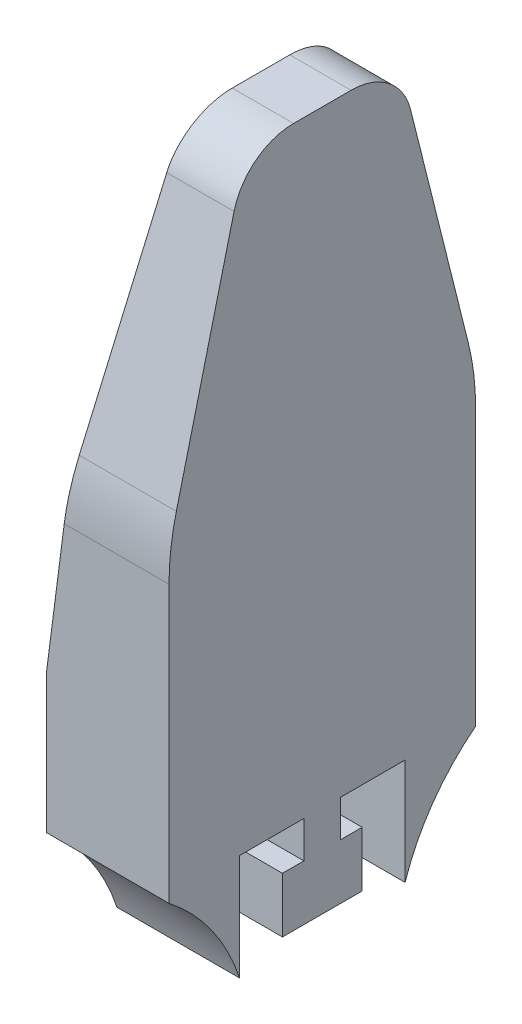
ISO-10303-21;
HEADER;
FILE_DESCRIPTION(('STEP AP214'),'2;1');
FILE_NAME('part.step','',(''),(''),'','','');
FILE_SCHEMA(('AUTOMOTIVE_DESIGN { 1 0 10303 214 1 1 1 1 }'));
ENDSEC;
DATA;
#1=APPLICATION_CONTEXT('core data for automotive mechanical design processes');
#2=APPLICATION_PROTOCOL_DEFINITION('international standard','automotive_design',2000,#1);
#3=PRODUCT_CONTEXT('',#1,'mechanical');
#4=PRODUCT('Part','Part','',(#3));
#5=PRODUCT_RELATED_PRODUCT_CATEGORY('part','',(#4));
#6=PRODUCT_DEFINITION_FORMATION('','',#4);
#7=PRODUCT_DEFINITION_CONTEXT('part definition',#1,'design');
#8=PRODUCT_DEFINITION('design','',#6,#7);
#9=PRODUCT_DEFINITION_SHAPE('','',#8);
#10=(LENGTH_UNIT() NAMED_UNIT(*) SI_UNIT(.MILLI.,.METRE.));
#11=(NAMED_UNIT(*) PLANE_ANGLE_UNIT() SI_UNIT($,.RADIAN.));
#12=(NAMED_UNIT(*) SI_UNIT($,.STERADIAN.) SOLID_ANGLE_UNIT());
#13=UNCERTAINTY_MEASURE_WITH_UNIT(LENGTH_MEASURE(1.E-05),#10,'distance_accuracy_value','');
#14=(GEOMETRIC_REPRESENTATION_CONTEXT(3) GLOBAL_UNCERTAINTY_ASSIGNED_CONTEXT((#13)) GLOBAL_UNIT_ASSIGNED_CONTEXT((#10,
#11,#12)) REPRESENTATION_CONTEXT('',''));
#15=CARTESIAN_POINT('',(0.,0.,0.));
#16=DIRECTION('',(0.,0.,1.));
#17=DIRECTION('',(1.,0.,0.));
#18=AXIS2_PLACEMENT_3D('',#15,#16,#17);
#19=CARTESIAN_POINT('',(-20.,-17.0483299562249,-46.0273279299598));
#20=DIRECTION('',(1.,0.,0.));
#21=DIRECTION('',(0.,0.,-1.));
#22=AXIS2_PLACEMENT_3D('',#19,#20,#21);
#23=CYLINDRICAL_SURFACE('',#22,34.2601907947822);
#24=CARTESIAN_POINT('',(0.,-17.0483299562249,-46.0273279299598));
#25=DIRECTION('',(1.,0.,0.));
#26=DIRECTION('',(0.,0.,-1.));
#27=AXIS2_PLACEMENT_3D('',#24,#25,#26);
#28=CIRCLE('',#27,34.2601907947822);
#29=CARTESIAN_POINT('',(0.,10.,-25.));
#30=VERTEX_POINT('',#29);
#31=CARTESIAN_POINT('',(0.,-6.29037424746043,-13.5));
#32=VERTEX_POINT('',#31);
#33=EDGE_CURVE('E212',#30,#32,#28,.T.);
#34=ORIENTED_EDGE('',*,*,#33,.T.);
#35=DIRECTION('',(1.,0.,0.));
#36=VECTOR('',#35,1.);
#37=CARTESIAN_POINT('',(-20.,-6.29037424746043,-13.5));
#38=LINE('',#37,#36);
#39=CARTESIAN_POINT('',(-20.,-6.29037424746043,-13.5));
#40=VERTEX_POINT('',#39);
#41=EDGE_CURVE('E11',#40,#32,#38,.T.);
#42=ORIENTED_EDGE('',*,*,#41,.F.);
#43=CARTESIAN_POINT('',(-20.,-17.0483299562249,-46.0273279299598));
#44=DIRECTION('',(1.,0.,0.));
#45=DIRECTION('',(0.,0.,-1.));
#46=AXIS2_PLACEMENT_3D('',#43,#44,#45);
#47=CIRCLE('',#46,34.2601907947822);
#48=CARTESIAN_POINT('',(-20.,10.,-25.));
#49=VERTEX_POINT('',#48);
#50=EDGE_CURVE('E273',#49,#40,#47,.T.);
#51=ORIENTED_EDGE('',*,*,#50,.F.);
#52=DIRECTION('',(1.,0.,0.));
#53=VECTOR('',#52,1.);
#54=CARTESIAN_POINT('',(-20.,10.,-25.));
#55=LINE('',#54,#53);
#56=EDGE_CURVE('E64',#49,#30,#55,.T.);
#57=ORIENTED_EDGE('',*,*,#56,.T.);
#58=EDGE_LOOP('',(#34,#42,#51,#57));
#59=FACE_BOUND('',#58,.T.);
#60=ADVANCED_FACE('F41',(#59),#23,.F.);
#61=CARTESIAN_POINT('',(-20.,-6.29037424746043,-13.5));
#62=DIRECTION('',(0.,0.,-1.));
#63=DIRECTION('',(0.,1.,0.));
#64=AXIS2_PLACEMENT_3D('',#61,#62,#63);
#65=PLANE('',#64);
#66=DIRECTION('',(0.,1.,0.));
#67=VECTOR('',#66,1.);
#68=CARTESIAN_POINT('',(0.,-6.29037424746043,-13.5));
#69=LINE('',#68,#67);
#70=CARTESIAN_POINT('',(0.,11.,-13.5));
#71=VERTEX_POINT('',#70);
#72=EDGE_CURVE('E214',#32,#71,#69,.T.);
#73=ORIENTED_EDGE('',*,*,#72,.T.);
#74=DIRECTION('',(1.,0.,0.));
#75=VECTOR('',#74,1.);
#76=CARTESIAN_POINT('',(-20.,11.,-13.5));
#77=LINE('',#76,#75);
#78=CARTESIAN_POINT('',(-20.,11.,-13.5));
#79=VERTEX_POINT('',#78);
#80=EDGE_CURVE('E48',#79,#71,#77,.T.);
#81=ORIENTED_EDGE('',*,*,#80,.F.);
#82=DIRECTION('',(0.,1.,0.));
#83=VECTOR('',#82,1.);
#84=CARTESIAN_POINT('',(-20.,-6.29037424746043,-13.5));
#85=LINE('',#84,#83);
#86=EDGE_CURVE('E145',#40,#79,#85,.T.);
#87=ORIENTED_EDGE('',*,*,#86,.F.);
#88=ORIENTED_EDGE('',*,*,#41,.T.);
#89=EDGE_LOOP('',(#73,#81,#87,#88));
#90=FACE_BOUND('',#89,.T.);
#91=ADVANCED_FACE('F316',(#90),#65,.F.);
#92=CARTESIAN_POINT('',(-20.,11.,-3.));
#93=DIRECTION('',(0.,-1.,0.));
#94=DIRECTION('',(0.,0.,-1.));
#95=AXIS2_PLACEMENT_3D('',#92,#93,#94);
#96=PLANE('',#95);
#97=DIRECTION('',(0.,0.,-1.));
#98=VECTOR('',#97,1.);
#99=CARTESIAN_POINT('',(0.,11.,-3.));
#100=LINE('',#99,#98);
#101=CARTESIAN_POINT('',(0.,11.,-3.));
#102=VERTEX_POINT('',#101);
#103=EDGE_CURVE('E218',#102,#71,#100,.T.);
#104=ORIENTED_EDGE('',*,*,#103,.F.);
#105=DIRECTION('',(1.,0.,0.));
#106=VECTOR('',#105,1.);
#107=CARTESIAN_POINT('',(-20.,11.,-3.));
#108=LINE('',#107,#106);
#109=CARTESIAN_POINT('',(-20.,11.,-3.));
#110=VERTEX_POINT('',#109);
#111=EDGE_CURVE('E309',#110,#102,#108,.T.);
#112=ORIENTED_EDGE('',*,*,#111,.F.);
#113=DIRECTION('',(0.,0.,-1.));
#114=VECTOR('',#113,1.);
#115=CARTESIAN_POINT('',(-20.,11.,-3.));
#116=LINE('',#115,#114);
#117=EDGE_CURVE('E315',#110,#79,#116,.T.);
#118=ORIENTED_EDGE('',*,*,#117,.T.);
#119=ORIENTED_EDGE('',*,*,#80,.T.);
#120=EDGE_LOOP('',(#104,#112,#118,#119));
#121=FACE_BOUND('',#120,.T.);
#122=ADVANCED_FACE('F313',(#121),#96,.T.);
#123=CARTESIAN_POINT('',(-20.,5.,-3.));
#124=DIRECTION('',(0.,0.,-1.));
#125=DIRECTION('',(-1.,0.,0.));
#126=AXIS2_PLACEMENT_3D('',#123,#124,#125);
#127=PLANE('',#126);
#128=DIRECTION('',(0.,1.,0.));
#129=VECTOR('',#128,1.);
#130=CARTESIAN_POINT('',(0.,5.,-3.));
#131=LINE('',#130,#129);
#132=CARTESIAN_POINT('',(0.,5.,-3.));
#133=VERTEX_POINT('',#132);
#134=EDGE_CURVE('E221',#133,#102,#131,.T.);
#135=ORIENTED_EDGE('',*,*,#134,.F.);
#136=DIRECTION('',(1.,0.,0.));
#137=VECTOR('',#136,1.);
#138=CARTESIAN_POINT('',(-20.,5.,-3.));
#139=LINE('',#138,#137);
#140=CARTESIAN_POINT('',(-20.,5.,-3.));
#141=VERTEX_POINT('',#140);
#142=EDGE_CURVE('E307',#141,#133,#139,.T.);
#143=ORIENTED_EDGE('',*,*,#142,.F.);
#144=DIRECTION('',(0.,1.,0.));
#145=VECTOR('',#144,1.);
#146=CARTESIAN_POINT('',(-20.,5.,-3.));
#147=LINE('',#146,#145);
#148=EDGE_CURVE('E327',#141,#110,#147,.T.);
#149=ORIENTED_EDGE('',*,*,#148,.T.);
#150=ORIENTED_EDGE('',*,*,#111,.T.);
#151=EDGE_LOOP('',(#135,#143,#149,#150));
#152=FACE_BOUND('',#151,.T.);
#153=ADVANCED_FACE('F323',(#152),#127,.T.);
#154=CARTESIAN_POINT('',(-20.,5.,-3.));
#155=DIRECTION('',(0.,-1.,0.));
#156=DIRECTION('',(0.,0.,-1.));
#157=AXIS2_PLACEMENT_3D('',#154,#155,#156);
#158=PLANE('',#157);
#159=DIRECTION('',(0.,0.,-1.));
#160=VECTOR('',#159,1.);
#161=CARTESIAN_POINT('',(0.,5.,-3.));
#162=LINE('',#161,#160);
#163=CARTESIAN_POINT('',(0.,5.,-6.5));
#164=VERTEX_POINT('',#163);
#165=EDGE_CURVE('E224',#133,#164,#162,.T.);
#166=ORIENTED_EDGE('',*,*,#165,.T.);
#167=DIRECTION('',(1.,0.,0.));
#168=VECTOR('',#167,1.);
#169=CARTESIAN_POINT('',(-20.,5.,-6.5));
#170=LINE('',#169,#168);
#171=CARTESIAN_POINT('',(-20.,5.,-6.5));
#172=VERTEX_POINT('',#171);
#173=EDGE_CURVE('E305',#172,#164,#170,.T.);
#174=ORIENTED_EDGE('',*,*,#173,.F.);
#175=DIRECTION('',(0.,0.,-1.));
#176=VECTOR('',#175,1.);
#177=CARTESIAN_POINT('',(-20.,5.,-3.));
#178=LINE('',#177,#176);
#179=EDGE_CURVE('E329',#141,#172,#178,.T.);
#180=ORIENTED_EDGE('',*,*,#179,.F.);
#181=ORIENTED_EDGE('',*,*,#142,.T.);
#182=EDGE_LOOP('',(#166,#174,#180,#181));
#183=FACE_BOUND('',#182,.T.);
#184=ADVANCED_FACE('F594',(#183),#158,.F.);
#185=CARTESIAN_POINT('',(-20.,-3.99999999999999,-6.5));
#186=DIRECTION('',(0.,0.,-1.));
#187=DIRECTION('',(0.,1.,0.));
#188=AXIS2_PLACEMENT_3D('',#185,#186,#187);
#189=PLANE('',#188);
#190=DIRECTION('',(0.,1.,0.));
#191=VECTOR('',#190,1.);
#192=CARTESIAN_POINT('',(0.,-3.99999999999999,-6.5));
#193=LINE('',#192,#191);
#194=CARTESIAN_POINT('',(0.,-3.99999999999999,-6.5));
#195=VERTEX_POINT('',#194);
#196=EDGE_CURVE('E227',#195,#164,#193,.T.);
#197=ORIENTED_EDGE('',*,*,#196,.F.);
#198=DIRECTION('',(1.,0.,0.));
#199=VECTOR('',#198,1.);
#200=CARTESIAN_POINT('',(-20.,-3.99999999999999,-6.5));
#201=LINE('',#200,#199);
#202=CARTESIAN_POINT('',(-20.,-3.99999999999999,-6.5));
#203=VERTEX_POINT('',#202);
#204=EDGE_CURVE('E303',#203,#195,#201,.T.);
#205=ORIENTED_EDGE('',*,*,#204,.F.);
#206=DIRECTION('',(0.,1.,0.));
#207=VECTOR('',#206,1.);
#208=CARTESIAN_POINT('',(-20.,-3.99999999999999,-6.5));
#209=LINE('',#208,#207);
#210=EDGE_CURVE('E335',#203,#172,#209,.T.);
#211=ORIENTED_EDGE('',*,*,#210,.T.);
#212=ORIENTED_EDGE('',*,*,#173,.T.);
#213=EDGE_LOOP('',(#197,#205,#211,#212));
#214=FACE_BOUND('',#213,.T.);
#215=ADVANCED_FACE('F584',(#214),#189,.T.);
#216=CARTESIAN_POINT('',(-20.,-3.99999999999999,6.5));
#217=DIRECTION('',(0.,-1.,0.));
#218=DIRECTION('',(0.,0.,-1.));
#219=AXIS2_PLACEMENT_3D('',#216,#217,#218);
#220=PLANE('',#219);
#221=DIRECTION('',(0.,0.,-1.));
#222=VECTOR('',#221,1.);
#223=CARTESIAN_POINT('',(0.,-3.99999999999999,6.5));
#224=LINE('',#223,#222);
#225=CARTESIAN_POINT('',(0.,-3.99999999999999,6.5));
#226=VERTEX_POINT('',#225);
#227=EDGE_CURVE('E230',#226,#195,#224,.T.);
#228=ORIENTED_EDGE('',*,*,#227,.F.);
#229=DIRECTION('',(1.,0.,0.));
#230=VECTOR('',#229,1.);
#231=CARTESIAN_POINT('',(-20.,-3.99999999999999,6.5));
#232=LINE('',#231,#230);
#233=CARTESIAN_POINT('',(-20.,-3.99999999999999,6.5));
#234=VERTEX_POINT('',#233);
#235=EDGE_CURVE('E301',#234,#226,#232,.T.);
#236=ORIENTED_EDGE('',*,*,#235,.F.);
#237=DIRECTION('',(0.,0.,-1.));
#238=VECTOR('',#237,1.);
#239=CARTESIAN_POINT('',(-20.,-3.99999999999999,6.5));
#240=LINE('',#239,#238);
#241=EDGE_CURVE('E338',#234,#203,#240,.T.);
#242=ORIENTED_EDGE('',*,*,#241,.T.);
#243=ORIENTED_EDGE('',*,*,#204,.T.);
#244=EDGE_LOOP('',(#228,#236,#242,#243));
#245=FACE_BOUND('',#244,.T.);
#246=ADVANCED_FACE('F574',(#245),#220,.T.);
#247=CARTESIAN_POINT('',(-20.,-3.99999999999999,6.5));
#248=DIRECTION('',(0.,0.,-1.));
#249=DIRECTION('',(-1.,0.,0.));
#250=AXIS2_PLACEMENT_3D('',#247,#248,#249);
#251=PLANE('',#250);
#252=DIRECTION('',(0.,1.,0.));
#253=VECTOR('',#252,1.);
#254=CARTESIAN_POINT('',(0.,-3.99999999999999,6.5));
#255=LINE('',#254,#253);
#256=CARTESIAN_POINT('',(0.,5.,6.5));
#257=VERTEX_POINT('',#256);
#258=EDGE_CURVE('E233',#226,#257,#255,.T.);
#259=ORIENTED_EDGE('',*,*,#258,.T.);
#260=DIRECTION('',(1.,0.,0.));
#261=VECTOR('',#260,1.);
#262=CARTESIAN_POINT('',(-20.,5.,6.5));
#263=LINE('',#262,#261);
#264=CARTESIAN_POINT('',(-20.,5.,6.5));
#265=VERTEX_POINT('',#264);
#266=EDGE_CURVE('E298',#265,#257,#263,.T.);
#267=ORIENTED_EDGE('',*,*,#266,.F.);
#268=DIRECTION('',(0.,1.,0.));
#269=VECTOR('',#268,1.);
#270=CARTESIAN_POINT('',(-20.,-3.99999999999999,6.5));
#271=LINE('',#270,#269);
#272=EDGE_CURVE('E341',#234,#265,#271,.T.);
#273=ORIENTED_EDGE('',*,*,#272,.F.);
#274=ORIENTED_EDGE('',*,*,#235,.T.);
#275=EDGE_LOOP('',(#259,#267,#273,#274));
#276=FACE_BOUND('',#275,.T.);
#277=ADVANCED_FACE('F564',(#276),#251,.F.);
#278=CARTESIAN_POINT('',(-20.,5.,6.5));
#279=DIRECTION('',(0.,-1.,0.));
#280=DIRECTION('',(0.,0.,-1.));
#281=AXIS2_PLACEMENT_3D('',#278,#279,#280);
#282=PLANE('',#281);
#283=DIRECTION('',(0.,0.,-1.));
#284=VECTOR('',#283,1.);
#285=CARTESIAN_POINT('',(0.,5.,6.5));
#286=LINE('',#285,#284);
#287=CARTESIAN_POINT('',(0.,5.,3.));
#288=VERTEX_POINT('',#287);
#289=EDGE_CURVE('E235',#257,#288,#286,.T.);
#290=ORIENTED_EDGE('',*,*,#289,.T.);
#291=DIRECTION('',(1.,0.,0.));
#292=VECTOR('',#291,1.);
#293=CARTESIAN_POINT('',(-20.,5.,3.));
#294=LINE('',#293,#292);
#295=CARTESIAN_POINT('',(-20.,5.,3.));
#296=VERTEX_POINT('',#295);
#297=EDGE_CURVE('E295',#296,#288,#294,.T.);
#298=ORIENTED_EDGE('',*,*,#297,.F.);
#299=DIRECTION('',(0.,0.,-1.));
#300=VECTOR('',#299,1.);
#301=CARTESIAN_POINT('',(-20.,5.,6.5));
#302=LINE('',#301,#300);
#303=EDGE_CURVE('E343',#265,#296,#302,.T.);
#304=ORIENTED_EDGE('',*,*,#303,.F.);
#305=ORIENTED_EDGE('',*,*,#266,.T.);
#306=EDGE_LOOP('',(#290,#298,#304,#305));
#307=FACE_BOUND('',#306,.T.);
#308=ADVANCED_FACE('F554',(#307),#282,.F.);
#309=CARTESIAN_POINT('',(-20.,5.,3.));
#310=DIRECTION('',(0.,0.,-1.));
#311=DIRECTION('',(-1.,0.,0.));
#312=AXIS2_PLACEMENT_3D('',#309,#310,#311);
#313=PLANE('',#312);
#314=DIRECTION('',(0.,1.,0.));
#315=VECTOR('',#314,1.);
#316=CARTESIAN_POINT('',(0.,5.,3.));
#317=LINE('',#316,#315);
#318=CARTESIAN_POINT('',(0.,11.,3.));
#319=VERTEX_POINT('',#318);
#320=EDGE_CURVE('E237',#288,#319,#317,.T.);
#321=ORIENTED_EDGE('',*,*,#320,.T.);
#322=DIRECTION('',(1.,0.,0.));
#323=VECTOR('',#322,1.);
#324=CARTESIAN_POINT('',(-20.,11.,3.));
#325=LINE('',#324,#323);
#326=CARTESIAN_POINT('',(-20.,11.,3.));
#327=VERTEX_POINT('',#326);
#328=EDGE_CURVE('E293',#327,#319,#325,.T.);
#329=ORIENTED_EDGE('',*,*,#328,.F.);
#330=DIRECTION('',(0.,1.,0.));
#331=VECTOR('',#330,1.);
#332=CARTESIAN_POINT('',(-20.,5.,3.));
#333=LINE('',#332,#331);
#334=EDGE_CURVE('E345',#296,#327,#333,.T.);
#335=ORIENTED_EDGE('',*,*,#334,.F.);
#336=ORIENTED_EDGE('',*,*,#297,.T.);
#337=EDGE_LOOP('',(#321,#329,#335,#336));
#338=FACE_BOUND('',#337,.T.);
#339=ADVANCED_FACE('F545',(#338),#313,.F.);
#340=CARTESIAN_POINT('',(-20.,11.,13.5));
#341=DIRECTION('',(0.,-1.,0.));
#342=DIRECTION('',(0.,0.,-1.));
#343=AXIS2_PLACEMENT_3D('',#340,#341,#342);
#344=PLANE('',#343);
#345=DIRECTION('',(0.,0.,-1.));
#346=VECTOR('',#345,1.);
#347=CARTESIAN_POINT('',(0.,11.,13.5));
#348=LINE('',#347,#346);
#349=CARTESIAN_POINT('',(0.,11.,13.5));
#350=VERTEX_POINT('',#349);
#351=EDGE_CURVE('E240',#350,#319,#348,.T.);
#352=ORIENTED_EDGE('',*,*,#351,.F.);
#353=DIRECTION('',(1.,0.,0.));
#354=VECTOR('',#353,1.);
#355=CARTESIAN_POINT('',(-20.,11.,13.5));
#356=LINE('',#355,#354);
#357=CARTESIAN_POINT('',(-20.,11.,13.5));
#358=VERTEX_POINT('',#357);
#359=EDGE_CURVE('E191',#358,#350,#356,.T.);
#360=ORIENTED_EDGE('',*,*,#359,.F.);
#361=DIRECTION('',(0.,0.,-1.));
#362=VECTOR('',#361,1.);
#363=CARTESIAN_POINT('',(-20.,11.,13.5));
#364=LINE('',#363,#362);
#365=EDGE_CURVE('E201',#358,#327,#364,.T.);
#366=ORIENTED_EDGE('',*,*,#365,.T.);
#367=ORIENTED_EDGE('',*,*,#328,.T.);
#368=EDGE_LOOP('',(#352,#360,#366,#367));
#369=FACE_BOUND('',#368,.T.);
#370=ADVANCED_FACE('F348',(#369),#344,.T.);
#371=CARTESIAN_POINT('',(-20.,-6.29037424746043,13.5));
#372=DIRECTION('',(0.,0.,-1.));
#373=DIRECTION('',(0.,1.,0.));
#374=AXIS2_PLACEMENT_3D('',#371,#372,#373);
#375=PLANE('',#374);
#376=DIRECTION('',(0.,1.,0.));
#377=VECTOR('',#376,1.);
#378=CARTESIAN_POINT('',(0.,-6.29037424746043,13.5));
#379=LINE('',#378,#377);
#380=CARTESIAN_POINT('',(0.,-6.29037424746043,13.5));
#381=VERTEX_POINT('',#380);
#382=EDGE_CURVE('E186',#381,#350,#379,.T.);
#383=ORIENTED_EDGE('',*,*,#382,.F.);
#384=DIRECTION('',(1.,0.,0.));
#385=VECTOR('',#384,1.);
#386=CARTESIAN_POINT('',(-20.,-6.29037424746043,13.5));
#387=LINE('',#386,#385);
#388=CARTESIAN_POINT('',(-20.,-6.29037424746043,13.5));
#389=VERTEX_POINT('',#388);
#390=EDGE_CURVE('E181',#389,#381,#387,.T.);
#391=ORIENTED_EDGE('',*,*,#390,.F.);
#392=DIRECTION('',(0.,1.,0.));
#393=VECTOR('',#392,1.);
#394=CARTESIAN_POINT('',(-20.,-6.29037424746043,13.5));
#395=LINE('',#394,#393);
#396=EDGE_CURVE('E184',#389,#358,#395,.T.);
#397=ORIENTED_EDGE('',*,*,#396,.T.);
#398=ORIENTED_EDGE('',*,*,#359,.T.);
#399=EDGE_LOOP('',(#383,#391,#397,#398));
#400=FACE_BOUND('',#399,.T.);
#401=ADVANCED_FACE('F183',(#400),#375,.T.);
#402=CARTESIAN_POINT('',(-20.,-17.0483299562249,46.0273279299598));
#403=DIRECTION('',(1.,0.,0.));
#404=DIRECTION('',(0.,0.,-1.));
#405=AXIS2_PLACEMENT_3D('',#402,#403,#404);
#406=CYLINDRICAL_SURFACE('',#405,34.2601907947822);
#407=CARTESIAN_POINT('',(0.,-17.0483299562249,46.0273279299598));
#408=DIRECTION('',(-1.,0.,0.));
#409=DIRECTION('',(0.,0.,1.));
#410=AXIS2_PLACEMENT_3D('',#407,#408,#409);
#411=CIRCLE('',#410,34.2601907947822);
#412=CARTESIAN_POINT('',(0.,10.,25.));
#413=VERTEX_POINT('',#412);
#414=EDGE_CURVE('E244',#413,#381,#411,.T.);
#415=ORIENTED_EDGE('',*,*,#414,.F.);
#416=DIRECTION('',(1.,0.,0.));
#417=VECTOR('',#416,1.);
#418=CARTESIAN_POINT('',(-20.,10.,25.));
#419=LINE('',#418,#417);
#420=CARTESIAN_POINT('',(-20.,10.,25.));
#421=VERTEX_POINT('',#420);
#422=EDGE_CURVE('E192',#421,#413,#419,.T.);
#423=ORIENTED_EDGE('',*,*,#422,.F.);
#424=CARTESIAN_POINT('',(-20.,-17.0483299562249,46.0273279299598));
#425=DIRECTION('',(-1.,0.,0.));
#426=DIRECTION('',(0.,0.,1.));
#427=AXIS2_PLACEMENT_3D('',#424,#425,#426);
#428=CIRCLE('',#427,34.2601907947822);
#429=EDGE_CURVE('E199',#421,#389,#428,.T.);
#430=ORIENTED_EDGE('',*,*,#429,.T.);
#431=ORIENTED_EDGE('',*,*,#390,.T.);
#432=EDGE_LOOP('',(#415,#423,#430,#431));
#433=FACE_BOUND('',#432,.T.);
#434=ADVANCED_FACE('F203',(#433),#406,.F.);
#435=CARTESIAN_POINT('',(-20.,10.,25.));
#436=DIRECTION('',(0.,0.,-1.));
#437=DIRECTION('',(-1.,0.,0.));
#438=AXIS2_PLACEMENT_3D('',#435,#436,#437);
#439=PLANE('',#438);
#440=DIRECTION('',(1.,0.,0.));
#441=VECTOR('',#440,1.);
#442=CARTESIAN_POINT('',(-20.,55.0757749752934,25.));
#443=LINE('',#442,#441);
#444=CARTESIAN_POINT('',(-17.0904630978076,55.0757749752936,25.));
#445=VERTEX_POINT('',#444);
#446=CARTESIAN_POINT('',(0.,55.0757749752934,25.));
#447=VERTEX_POINT('',#446);
#448=EDGE_CURVE('E289',#445,#447,#443,.T.);
#449=ORIENTED_EDGE('',*,*,#448,.F.);
#450=DIRECTION('',(0.128032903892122,0.991769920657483,0.));
#451=VECTOR('',#450,1.);
#452=CARTESIAN_POINT('',(-10.,110.,25.));
#453=LINE('',#452,#451);
#454=CARTESIAN_POINT('',(-20.,32.5378874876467,25.));
#455=VERTEX_POINT('',#454);
#456=EDGE_CURVE('E361',#455,#445,#453,.T.);
#457=ORIENTED_EDGE('',*,*,#456,.F.);
#458=DIRECTION('',(0.,1.,0.));
#459=VECTOR('',#458,1.);
#460=CARTESIAN_POINT('',(-20.,10.,25.));
#461=LINE('',#460,#459);
#462=EDGE_CURVE('E205',#421,#455,#461,.T.);
#463=ORIENTED_EDGE('',*,*,#462,.F.);
#464=ORIENTED_EDGE('',*,*,#422,.T.);
#465=DIRECTION('',(0.,1.,0.));
#466=VECTOR('',#465,1.);
#467=CARTESIAN_POINT('',(0.,10.,25.));
#468=LINE('',#467,#466);
#469=EDGE_CURVE('E246',#413,#447,#468,.T.);
#470=ORIENTED_EDGE('',*,*,#469,.T.);
#471=EDGE_LOOP('',(#449,#457,#463,#464,#470));
#472=FACE_BOUND('',#471,.T.);
#473=ADVANCED_FACE('F356',(#472),#439,.F.);
#474=CARTESIAN_POINT('',(-20.,55.0757749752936,-15.));
#475=DIRECTION('',(1.,0.,0.));
#476=DIRECTION('',(0.,0.,-1.));
#477=AXIS2_PLACEMENT_3D('',#474,#475,#476);
#478=CYLINDRICAL_SURFACE('',#477,40.);
#479=CARTESIAN_POINT('',(-17.0904630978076,55.0757749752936,-15.));
#480=DIRECTION('',(0.991769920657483,-0.128032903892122,0.));
#481=DIRECTION('',(0.128032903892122,0.991769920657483,0.));
#482=AXIS2_PLACEMENT_3D('',#479,#480,#481);
#483=ELLIPSE('',#482,40.3319350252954,40.);
#484=CARTESIAN_POINT('',(-15.8380540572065,64.7771999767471,23.8057000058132));
#485=VERTEX_POINT('',#484);
#486=EDGE_CURVE('E215',#445,#485,#483,.F.);
#487=ORIENTED_EDGE('',*,*,#486,.F.);
#488=ORIENTED_EDGE('',*,*,#448,.T.);
#489=CARTESIAN_POINT('',(0.,55.0757749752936,-15.));
#490=DIRECTION('',(1.,0.,0.));
#491=DIRECTION('',(0.,0.,-1.));
#492=AXIS2_PLACEMENT_3D('',#489,#490,#491);
#493=CIRCLE('',#492,40.);
#494=CARTESIAN_POINT('',(0.,64.7771999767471,23.8057000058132));
#495=VERTEX_POINT('',#494);
#496=EDGE_CURVE('E249',#495,#447,#493,.T.);
#497=ORIENTED_EDGE('',*,*,#496,.F.);
#498=DIRECTION('',(1.,0.,0.));
#499=VECTOR('',#498,1.);
#500=CARTESIAN_POINT('',(-20.,64.7771999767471,23.8057000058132));
#501=LINE('',#500,#499);
#502=EDGE_CURVE('E287',#485,#495,#501,.T.);
#503=ORIENTED_EDGE('',*,*,#502,.F.);
#504=EDGE_LOOP('',(#487,#488,#497,#503));
#505=FACE_BOUND('',#504,.T.);
#506=ADVANCED_FACE('F396',(#505),#478,.T.);
#507=CARTESIAN_POINT('',(-20.,64.7771999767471,23.8057000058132));
#508=DIRECTION('',(0.,-0.242535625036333,-0.970142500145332));
#509=DIRECTION('',(0.,0.970142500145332,-0.242535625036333));
#510=AXIS2_PLACEMENT_3D('',#507,#508,#509);
#511=PLANE('',#510);
#512=DIRECTION('',(1.,0.,0.));
#513=VECTOR('',#512,1.);
#514=CARTESIAN_POINT('',(-20.,102.425356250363,14.3936609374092));
#515=LINE('',#514,#513);
#516=CARTESIAN_POINT('',(-10.977851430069,102.425356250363,14.3936609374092));
#517=VERTEX_POINT('',#516);
#518=CARTESIAN_POINT('',(0.,102.425356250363,14.3936609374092));
#519=VERTEX_POINT('',#518);
#520=EDGE_CURVE('E285',#517,#519,#515,.T.);
#521=ORIENTED_EDGE('',*,*,#520,.F.);
#522=DIRECTION('',(-0.124270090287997,-0.962622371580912,0.240655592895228));
#523=VECTOR('',#522,1.);
#524=CARTESIAN_POINT('',(-15.9023272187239,64.2793264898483,23.9301683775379));
#525=LINE('',#524,#523);
#526=EDGE_CURVE('E384',#517,#485,#525,.T.);
#527=ORIENTED_EDGE('',*,*,#526,.T.);
#528=ORIENTED_EDGE('',*,*,#502,.T.);
#529=DIRECTION('',(0.,0.970142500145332,-0.242535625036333));
#530=VECTOR('',#529,1.);
#531=CARTESIAN_POINT('',(0.,64.7771999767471,23.8057000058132));
#532=LINE('',#531,#530);
#533=EDGE_CURVE('E252',#495,#519,#532,.T.);
#534=ORIENTED_EDGE('',*,*,#533,.T.);
#535=EDGE_LOOP('',(#521,#527,#528,#534));
#536=FACE_BOUND('',#535,.T.);
#537=ADVANCED_FACE('F393',(#536),#511,.F.);
#538=CARTESIAN_POINT('',(-20.,100.,4.69223593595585));
#539=DIRECTION('',(1.,0.,0.));
#540=DIRECTION('',(0.,0.,-1.));
#541=AXIS2_PLACEMENT_3D('',#538,#539,#540);
#542=CYLINDRICAL_SURFACE('',#541,10.);
#543=DIRECTION('',(1.,0.,0.));
#544=VECTOR('',#543,1.);
#545=CARTESIAN_POINT('',(-20.,110.,4.69223593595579));
#546=LINE('',#545,#544);
#547=CARTESIAN_POINT('',(-10.,110.,4.69223593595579));
#548=VERTEX_POINT('',#547);
#549=CARTESIAN_POINT('',(0.,110.,4.69223593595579));
#550=VERTEX_POINT('',#549);
#551=EDGE_CURVE('E283',#548,#550,#546,.T.);
#552=ORIENTED_EDGE('',*,*,#551,.F.);
#553=CARTESIAN_POINT('',(-11.2909536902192,100.,4.69223593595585));
#554=DIRECTION('',(0.991769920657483,-0.128032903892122,0.));
#555=DIRECTION('',(0.128032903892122,0.991769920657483,0.));
#556=AXIS2_PLACEMENT_3D('',#553,#554,#555);
#557=ELLIPSE('',#556,10.0829837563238,10.);
#558=EDGE_CURVE('E394',#548,#517,#557,.T.);
#559=ORIENTED_EDGE('',*,*,#558,.T.);
#560=ORIENTED_EDGE('',*,*,#520,.T.);
#561=CARTESIAN_POINT('',(0.,100.,4.69223593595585));
#562=DIRECTION('',(-1.,0.,0.));
#563=DIRECTION('',(0.,0.,1.));
#564=AXIS2_PLACEMENT_3D('',#561,#562,#563);
#565=CIRCLE('',#564,10.);
#566=EDGE_CURVE('E255',#519,#550,#565,.T.);
#567=ORIENTED_EDGE('',*,*,#566,.T.);
#568=EDGE_LOOP('',(#552,#559,#560,#567));
#569=FACE_BOUND('',#568,.T.);
#570=ADVANCED_FACE('F403',(#569),#542,.T.);
#571=CARTESIAN_POINT('',(-20.,110.,4.69223593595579));
#572=DIRECTION('',(0.,-1.,0.));
#573=DIRECTION('',(0.,0.,-1.));
#574=AXIS2_PLACEMENT_3D('',#571,#572,#573);
#575=PLANE('',#574);
#576=DIRECTION('',(1.,0.,0.));
#577=VECTOR('',#576,1.);
#578=CARTESIAN_POINT('',(-20.,110.,-4.6922359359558));
#579=LINE('',#578,#577);
#580=CARTESIAN_POINT('',(-10.,110.,-4.69223593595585));
#581=VERTEX_POINT('',#580);
#582=CARTESIAN_POINT('',(0.,110.,-4.6922359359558));
#583=VERTEX_POINT('',#582);
#584=EDGE_CURVE('E281',#581,#583,#579,.T.);
#585=ORIENTED_EDGE('',*,*,#584,.F.);
#586=DIRECTION('',(0.,0.,1.));
#587=VECTOR('',#586,1.);
#588=CARTESIAN_POINT('',(-10.,110.,-25.));
#589=LINE('',#588,#587);
#590=EDGE_CURVE('E434',#581,#548,#589,.T.);
#591=ORIENTED_EDGE('',*,*,#590,.T.);
#592=ORIENTED_EDGE('',*,*,#551,.T.);
#593=DIRECTION('',(0.,0.,-1.));
#594=VECTOR('',#593,1.);
#595=CARTESIAN_POINT('',(0.,110.,4.69223593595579));
#596=LINE('',#595,#594);
#597=EDGE_CURVE('E258',#550,#583,#596,.T.);
#598=ORIENTED_EDGE('',*,*,#597,.T.);
#599=EDGE_LOOP('',(#585,#591,#592,#598));
#600=FACE_BOUND('',#599,.T.);
#601=ADVANCED_FACE('F431',(#600),#575,.F.);
#602=CARTESIAN_POINT('',(-20.,100.,-4.69223593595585));
#603=DIRECTION('',(1.,0.,0.));
#604=DIRECTION('',(0.,0.,-1.));
#605=AXIS2_PLACEMENT_3D('',#602,#603,#604);
#606=CYLINDRICAL_SURFACE('',#605,10.);
#607=CARTESIAN_POINT('',(-11.2909536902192,100.,-4.69223593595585));
#608=DIRECTION('',(0.991769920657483,-0.128032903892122,0.));
#609=DIRECTION('',(0.128032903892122,0.991769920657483,0.));
#610=AXIS2_PLACEMENT_3D('',#607,#608,#609);
#611=ELLIPSE('',#610,10.0829837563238,10.);
#612=CARTESIAN_POINT('',(-10.977851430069,102.425356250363,-14.3936609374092));
#613=VERTEX_POINT('',#612);
#614=EDGE_CURVE('E436',#581,#613,#611,.F.);
#615=ORIENTED_EDGE('',*,*,#614,.F.);
#616=ORIENTED_EDGE('',*,*,#584,.T.);
#617=CARTESIAN_POINT('',(0.,100.,-4.69223593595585));
#618=DIRECTION('',(1.,0.,0.));
#619=DIRECTION('',(0.,0.,-1.));
#620=AXIS2_PLACEMENT_3D('',#617,#618,#619);
#621=CIRCLE('',#620,10.);
#622=CARTESIAN_POINT('',(0.,102.425356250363,-14.3936609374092));
#623=VERTEX_POINT('',#622);
#624=EDGE_CURVE('E261',#623,#583,#621,.T.);
#625=ORIENTED_EDGE('',*,*,#624,.F.);
#626=DIRECTION('',(1.,0.,0.));
#627=VECTOR('',#626,1.);
#628=CARTESIAN_POINT('',(-20.,102.425356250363,-14.3936609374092));
#629=LINE('',#628,#627);
#630=EDGE_CURVE('E279',#613,#623,#629,.T.);
#631=ORIENTED_EDGE('',*,*,#630,.F.);
#632=EDGE_LOOP('',(#615,#616,#625,#631));
#633=FACE_BOUND('',#632,.T.);
#634=ADVANCED_FACE('F426',(#633),#606,.T.);
#635=CARTESIAN_POINT('',(-20.,64.777199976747,-23.8057000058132));
#636=DIRECTION('',(0.,0.242535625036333,-0.970142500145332));
#637=DIRECTION('',(0.,0.970142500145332,0.242535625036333));
#638=AXIS2_PLACEMENT_3D('',#635,#636,#637);
#639=PLANE('',#638);
#640=DIRECTION('',(-0.124270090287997,-0.962622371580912,-0.240655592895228));
#641=VECTOR('',#640,1.);
#642=CARTESIAN_POINT('',(-15.9023272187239,64.2793264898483,-23.9301683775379));
#643=LINE('',#642,#641);
#644=CARTESIAN_POINT('',(-15.8380540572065,64.777199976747,-23.8057000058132));
#645=VERTEX_POINT('',#644);
#646=EDGE_CURVE('E423',#613,#645,#643,.T.);
#647=ORIENTED_EDGE('',*,*,#646,.F.);
#648=ORIENTED_EDGE('',*,*,#630,.T.);
#649=DIRECTION('',(0.,0.970142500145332,0.242535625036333));
#650=VECTOR('',#649,1.);
#651=CARTESIAN_POINT('',(0.,64.777199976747,-23.8057000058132));
#652=LINE('',#651,#650);
#653=CARTESIAN_POINT('',(0.,64.777199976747,-23.8057000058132));
#654=VERTEX_POINT('',#653);
#655=EDGE_CURVE('E264',#654,#623,#652,.T.);
#656=ORIENTED_EDGE('',*,*,#655,.F.);
#657=DIRECTION('',(1.,0.,0.));
#658=VECTOR('',#657,1.);
#659=CARTESIAN_POINT('',(-20.,64.777199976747,-23.8057000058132));
#660=LINE('',#659,#658);
#661=EDGE_CURVE('E277',#645,#654,#660,.T.);
#662=ORIENTED_EDGE('',*,*,#661,.F.);
#663=EDGE_LOOP('',(#647,#648,#656,#662));
#664=FACE_BOUND('',#663,.T.);
#665=ADVANCED_FACE('F420',(#664),#639,.T.);
#666=CARTESIAN_POINT('',(-20.,55.0757749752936,15.));
#667=DIRECTION('',(1.,0.,0.));
#668=DIRECTION('',(0.,0.,-1.));
#669=AXIS2_PLACEMENT_3D('',#666,#667,#668);
#670=CYLINDRICAL_SURFACE('',#669,40.);
#671=DIRECTION('',(1.,0.,0.));
#672=VECTOR('',#671,1.);
#673=CARTESIAN_POINT('',(-20.,55.0757749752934,-25.));
#674=LINE('',#673,#672);
#675=CARTESIAN_POINT('',(-17.0904630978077,55.0757749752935,-25.));
#676=VERTEX_POINT('',#675);
#677=CARTESIAN_POINT('',(0.,55.0757749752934,-25.));
#678=VERTEX_POINT('',#677);
#679=EDGE_CURVE('E275',#676,#678,#674,.T.);
#680=ORIENTED_EDGE('',*,*,#679,.F.);
#681=CARTESIAN_POINT('',(-17.0904630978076,55.0757749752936,15.));
#682=DIRECTION('',(0.991769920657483,-0.128032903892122,0.));
#683=DIRECTION('',(0.128032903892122,0.991769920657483,0.));
#684=AXIS2_PLACEMENT_3D('',#681,#682,#683);
#685=ELLIPSE('',#684,40.3319350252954,40.);
#686=EDGE_CURVE('E441',#676,#645,#685,.T.);
#687=ORIENTED_EDGE('',*,*,#686,.T.);
#688=ORIENTED_EDGE('',*,*,#661,.T.);
#689=CARTESIAN_POINT('',(0.,55.0757749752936,15.));
#690=DIRECTION('',(-1.,0.,0.));
#691=DIRECTION('',(0.,0.,1.));
#692=AXIS2_PLACEMENT_3D('',#689,#690,#691);
#693=CIRCLE('',#692,40.);
#694=EDGE_CURVE('E267',#654,#678,#693,.T.);
#695=ORIENTED_EDGE('',*,*,#694,.T.);
#696=EDGE_LOOP('',(#680,#687,#688,#695));
#697=FACE_BOUND('',#696,.T.);
#698=ADVANCED_FACE('F415',(#697),#670,.T.);
#699=CARTESIAN_POINT('',(-20.,10.,-25.));
#700=DIRECTION('',(0.,0.,-1.));
#701=DIRECTION('',(-1.,0.,0.));
#702=AXIS2_PLACEMENT_3D('',#699,#700,#701);
#703=PLANE('',#702);
#704=DIRECTION('',(0.128032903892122,0.991769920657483,0.));
#705=VECTOR('',#704,1.);
#706=CARTESIAN_POINT('',(-10.,110.,-25.));
#707=LINE('',#706,#705);
#708=CARTESIAN_POINT('',(-20.,32.5378874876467,-25.));
#709=VERTEX_POINT('',#708);
#710=EDGE_CURVE('E55',#709,#676,#707,.T.);
#711=ORIENTED_EDGE('',*,*,#710,.T.);
#712=ORIENTED_EDGE('',*,*,#679,.T.);
#713=DIRECTION('',(0.,1.,0.));
#714=VECTOR('',#713,1.);
#715=CARTESIAN_POINT('',(0.,10.,-25.));
#716=LINE('',#715,#714);
#717=EDGE_CURVE('E270',#30,#678,#716,.T.);
#718=ORIENTED_EDGE('',*,*,#717,.F.);
#719=ORIENTED_EDGE('',*,*,#56,.F.);
#720=DIRECTION('',(0.,1.,0.));
#721=VECTOR('',#720,1.);
#722=CARTESIAN_POINT('',(-20.,10.,-25.));
#723=LINE('',#722,#721);
#724=EDGE_CURVE('E207',#49,#709,#723,.T.);
#725=ORIENTED_EDGE('',*,*,#724,.T.);
#726=EDGE_LOOP('',(#711,#712,#718,#719,#725));
#727=FACE_BOUND('',#726,.T.);
#728=ADVANCED_FACE('F411',(#727),#703,.T.);
#729=CARTESIAN_POINT('',(-20.,-17.0483299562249,-46.0273279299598));
#730=DIRECTION('',(1.,0.,0.));
#731=DIRECTION('',(0.,0.,-1.));
#732=AXIS2_PLACEMENT_3D('',#729,#730,#731);
#733=PLANE('',#732);
#734=ORIENTED_EDGE('',*,*,#462,.T.);
#735=DIRECTION('',(0.,0.,1.));
#736=VECTOR('',#735,1.);
#737=CARTESIAN_POINT('',(-20.,32.5378874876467,-25.));
#738=LINE('',#737,#736);
#739=EDGE_CURVE('E363',#709,#455,#738,.T.);
#740=ORIENTED_EDGE('',*,*,#739,.F.);
#741=ORIENTED_EDGE('',*,*,#724,.F.);
#742=ORIENTED_EDGE('',*,*,#50,.T.);
#743=ORIENTED_EDGE('',*,*,#86,.T.);
#744=ORIENTED_EDGE('',*,*,#117,.F.);
#745=ORIENTED_EDGE('',*,*,#148,.F.);
#746=ORIENTED_EDGE('',*,*,#179,.T.);
#747=ORIENTED_EDGE('',*,*,#210,.F.);
#748=ORIENTED_EDGE('',*,*,#241,.F.);
#749=ORIENTED_EDGE('',*,*,#272,.T.);
#750=ORIENTED_EDGE('',*,*,#303,.T.);
#751=ORIENTED_EDGE('',*,*,#334,.T.);
#752=ORIENTED_EDGE('',*,*,#365,.F.);
#753=ORIENTED_EDGE('',*,*,#396,.F.);
#754=ORIENTED_EDGE('',*,*,#429,.F.);
#755=EDGE_LOOP('',(#734,#740,#741,#742,#743,#744,#745,#746,#747,#748,#749,#750,#751,#752,#753,#754));
#756=FACE_BOUND('',#755,.T.);
#757=ADVANCED_FACE('F198',(#756),#733,.F.);
#758=CARTESIAN_POINT('',(0.,-17.0483299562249,-46.0273279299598));
#759=DIRECTION('',(1.,0.,0.));
#760=DIRECTION('',(0.,0.,-1.));
#761=AXIS2_PLACEMENT_3D('',#758,#759,#760);
#762=PLANE('',#761);
#763=ORIENTED_EDGE('',*,*,#33,.F.);
#764=ORIENTED_EDGE('',*,*,#717,.T.);
#765=ORIENTED_EDGE('',*,*,#694,.F.);
#766=ORIENTED_EDGE('',*,*,#655,.T.);
#767=ORIENTED_EDGE('',*,*,#624,.T.);
#768=ORIENTED_EDGE('',*,*,#597,.F.);
#769=ORIENTED_EDGE('',*,*,#566,.F.);
#770=ORIENTED_EDGE('',*,*,#533,.F.);
#771=ORIENTED_EDGE('',*,*,#496,.T.);
#772=ORIENTED_EDGE('',*,*,#469,.F.);
#773=ORIENTED_EDGE('',*,*,#414,.T.);
#774=ORIENTED_EDGE('',*,*,#382,.T.);
#775=ORIENTED_EDGE('',*,*,#351,.T.);
#776=ORIENTED_EDGE('',*,*,#320,.F.);
#777=ORIENTED_EDGE('',*,*,#289,.F.);
#778=ORIENTED_EDGE('',*,*,#258,.F.);
#779=ORIENTED_EDGE('',*,*,#227,.T.);
#780=ORIENTED_EDGE('',*,*,#196,.T.);
#781=ORIENTED_EDGE('',*,*,#165,.F.);
#782=ORIENTED_EDGE('',*,*,#134,.T.);
#783=ORIENTED_EDGE('',*,*,#103,.T.);
#784=ORIENTED_EDGE('',*,*,#72,.F.);
#785=EDGE_LOOP('',(#763,#764,#765,#766,#767,#768,#769,#770,#771,#772,#773,#774,#775,#776,#777,
#778,#779,#780,#781,#782,#783,#784));
#786=FACE_BOUND('',#785,.T.);
#787=ADVANCED_FACE('F319',(#786),#762,.T.);
#788=CARTESIAN_POINT('',(-10.,110.,-25.));
#789=DIRECTION('',(0.991769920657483,-0.128032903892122,0.));
#790=DIRECTION('',(0.128032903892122,0.991769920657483,0.));
#791=AXIS2_PLACEMENT_3D('',#788,#789,#790);
#792=PLANE('',#791);
#793=ORIENTED_EDGE('',*,*,#486,.T.);
#794=ORIENTED_EDGE('',*,*,#526,.F.);
#795=ORIENTED_EDGE('',*,*,#558,.F.);
#796=ORIENTED_EDGE('',*,*,#590,.F.);
#797=ORIENTED_EDGE('',*,*,#614,.T.);
#798=ORIENTED_EDGE('',*,*,#646,.T.);
#799=ORIENTED_EDGE('',*,*,#686,.F.);
#800=ORIENTED_EDGE('',*,*,#710,.F.);
#801=ORIENTED_EDGE('',*,*,#739,.T.);
#802=ORIENTED_EDGE('',*,*,#456,.T.);
#803=EDGE_LOOP('',(#793,#794,#795,#796,#797,#798,#799,#800,#801,#802));
#804=FACE_BOUND('',#803,.T.);
#805=ADVANCED_FACE('F387',(#804),#792,.F.);
#806=CLOSED_SHELL('',(#60,#91,#122,#153,#184,#215,#246,#277,#308,#339,#370,#401,#434,#473,#506,
#537,#570,#601,#634,#665,#698,#728,#757,#787,#805));
#807=MANIFOLD_SOLID_BREP('B2',#806);
#808=ADVANCED_BREP_SHAPE_REPRESENTATION('',(#18,#807),#14);
#809=SHAPE_DEFINITION_REPRESENTATION(#9,#808);
ENDSEC;
END-ISO-10303-21;
